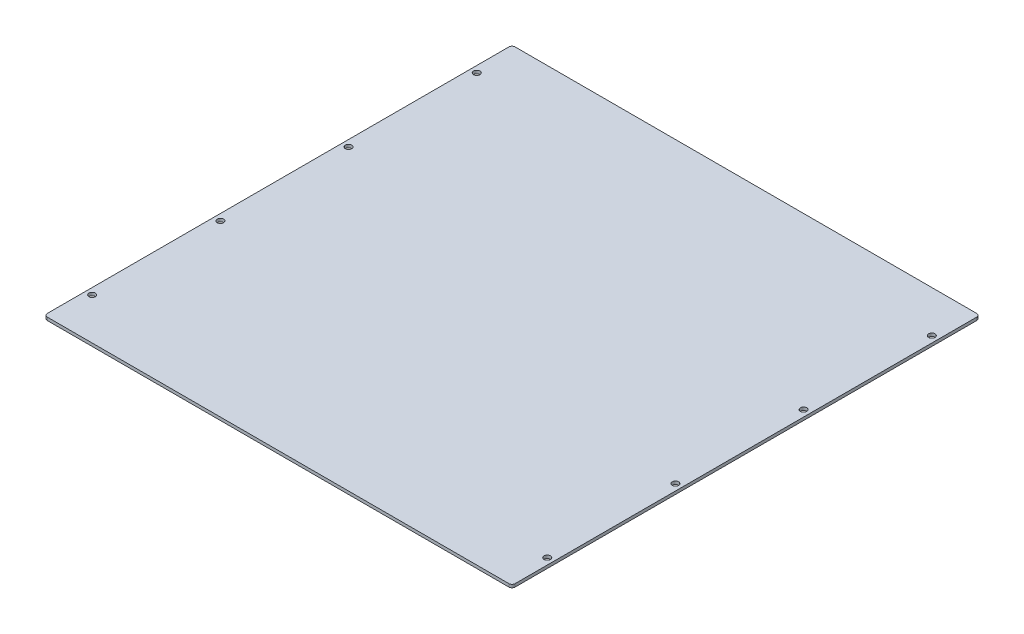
ISO-10303-21;
HEADER;
FILE_DESCRIPTION(('STEP AP214'),'2;1');
FILE_NAME('part.step','',(''),(''),'','','');
FILE_SCHEMA(('AUTOMOTIVE_DESIGN { 1 0 10303 214 1 1 1 1 }'));
ENDSEC;
DATA;
#1=APPLICATION_CONTEXT('core data for automotive mechanical design processes');
#2=APPLICATION_PROTOCOL_DEFINITION('international standard','automotive_design',2000,#1);
#3=PRODUCT_CONTEXT('',#1,'mechanical');
#4=PRODUCT('Part','Part','',(#3));
#5=PRODUCT_RELATED_PRODUCT_CATEGORY('part','',(#4));
#6=PRODUCT_DEFINITION_FORMATION('','',#4);
#7=PRODUCT_DEFINITION_CONTEXT('part definition',#1,'design');
#8=PRODUCT_DEFINITION('design','',#6,#7);
#9=PRODUCT_DEFINITION_SHAPE('','',#8);
#10=(LENGTH_UNIT() NAMED_UNIT(*) SI_UNIT(.MILLI.,.METRE.));
#11=(NAMED_UNIT(*) PLANE_ANGLE_UNIT() SI_UNIT($,.RADIAN.));
#12=(NAMED_UNIT(*) SI_UNIT($,.STERADIAN.) SOLID_ANGLE_UNIT());
#13=UNCERTAINTY_MEASURE_WITH_UNIT(LENGTH_MEASURE(1.E-05),#10,'distance_accuracy_value','');
#14=(GEOMETRIC_REPRESENTATION_CONTEXT(3) GLOBAL_UNCERTAINTY_ASSIGNED_CONTEXT((#13)) GLOBAL_UNIT_ASSIGNED_CONTEXT((#10,
#11,#12)) REPRESENTATION_CONTEXT('',''));
#15=CARTESIAN_POINT('',(0.,0.,0.));
#16=DIRECTION('',(0.,0.,1.));
#17=DIRECTION('',(1.,0.,0.));
#18=AXIS2_PLACEMENT_3D('',#15,#16,#17);
#19=CARTESIAN_POINT('',(231.775,2.9972,-231.775));
#20=DIRECTION('',(-1.,0.,0.));
#21=DIRECTION('',(0.,0.,1.));
#22=AXIS2_PLACEMENT_3D('',#19,#20,#21);
#23=PLANE('',#22);
#24=DIRECTION('',(0.,0.,-1.));
#25=VECTOR('',#24,1.);
#26=CARTESIAN_POINT('',(231.775,0.,-231.775));
#27=LINE('',#26,#25);
#28=CARTESIAN_POINT('',(231.775,0.,228.6));
#29=VERTEX_POINT('',#28);
#30=CARTESIAN_POINT('',(231.775,0.,-228.6));
#31=VERTEX_POINT('',#30);
#32=EDGE_CURVE('E149',#29,#31,#27,.T.);
#33=ORIENTED_EDGE('',*,*,#32,.T.);
#34=DIRECTION('',(0.,-1.,0.));
#35=VECTOR('',#34,1.);
#36=CARTESIAN_POINT('',(231.775,2.9972,-228.6));
#37=LINE('',#36,#35);
#38=CARTESIAN_POINT('',(231.775,2.9972,-228.6));
#39=VERTEX_POINT('',#38);
#40=EDGE_CURVE('E183',#31,#39,#37,.F.);
#41=ORIENTED_EDGE('',*,*,#40,.T.);
#42=DIRECTION('',(0.,0.,-1.));
#43=VECTOR('',#42,1.);
#44=CARTESIAN_POINT('',(231.775,2.9972,-231.775));
#45=LINE('',#44,#43);
#46=CARTESIAN_POINT('',(231.775,2.9972,228.6));
#47=VERTEX_POINT('',#46);
#48=EDGE_CURVE('E147',#47,#39,#45,.T.);
#49=ORIENTED_EDGE('',*,*,#48,.F.);
#50=DIRECTION('',(0.,-1.,0.));
#51=VECTOR('',#50,1.);
#52=CARTESIAN_POINT('',(231.775,2.9972,228.6));
#53=LINE('',#52,#51);
#54=EDGE_CURVE('E179',#47,#29,#53,.T.);
#55=ORIENTED_EDGE('',*,*,#54,.T.);
#56=EDGE_LOOP('',(#33,#41,#49,#55));
#57=FACE_BOUND('',#56,.T.);
#58=ADVANCED_FACE('F47',(#57),#23,.F.);
#59=CARTESIAN_POINT('',(-231.775,2.9972,-231.775));
#60=DIRECTION('',(0.,0.,1.));
#61=DIRECTION('',(1.,0.,0.));
#62=AXIS2_PLACEMENT_3D('',#59,#60,#61);
#63=PLANE('',#62);
#64=DIRECTION('',(-1.,0.,0.));
#65=VECTOR('',#64,1.);
#66=CARTESIAN_POINT('',(-231.775,0.,-231.775));
#67=LINE('',#66,#65);
#68=CARTESIAN_POINT('',(228.6,0.,-231.775));
#69=VERTEX_POINT('',#68);
#70=CARTESIAN_POINT('',(-228.6,0.,-231.775));
#71=VERTEX_POINT('',#70);
#72=EDGE_CURVE('E142',#69,#71,#67,.T.);
#73=ORIENTED_EDGE('',*,*,#72,.T.);
#74=DIRECTION('',(0.,-1.,0.));
#75=VECTOR('',#74,1.);
#76=CARTESIAN_POINT('',(-228.6,2.9972,-231.775));
#77=LINE('',#76,#75);
#78=CARTESIAN_POINT('',(-228.6,2.9972,-231.775));
#79=VERTEX_POINT('',#78);
#80=EDGE_CURVE('E118',#71,#79,#77,.F.);
#81=ORIENTED_EDGE('',*,*,#80,.T.);
#82=DIRECTION('',(-1.,0.,0.));
#83=VECTOR('',#82,1.);
#84=CARTESIAN_POINT('',(-231.775,2.9972,-231.775));
#85=LINE('',#84,#83);
#86=CARTESIAN_POINT('',(228.6,2.9972,-231.775));
#87=VERTEX_POINT('',#86);
#88=EDGE_CURVE('E203',#87,#79,#85,.T.);
#89=ORIENTED_EDGE('',*,*,#88,.F.);
#90=DIRECTION('',(0.,-1.,0.));
#91=VECTOR('',#90,1.);
#92=CARTESIAN_POINT('',(228.6,2.9972,-231.775));
#93=LINE('',#92,#91);
#94=EDGE_CURVE('E124',#87,#69,#93,.T.);
#95=ORIENTED_EDGE('',*,*,#94,.T.);
#96=EDGE_LOOP('',(#73,#81,#89,#95));
#97=FACE_BOUND('',#96,.T.);
#98=ADVANCED_FACE('F309',(#97),#63,.F.);
#99=CARTESIAN_POINT('',(-231.775,2.9972,-231.775));
#100=DIRECTION('',(1.,0.,0.));
#101=DIRECTION('',(0.,0.,-1.));
#102=AXIS2_PLACEMENT_3D('',#99,#100,#101);
#103=PLANE('',#102);
#104=DIRECTION('',(0.,0.,1.));
#105=VECTOR('',#104,1.);
#106=CARTESIAN_POINT('',(-231.775,2.9972,-231.775));
#107=LINE('',#106,#105);
#108=CARTESIAN_POINT('',(-231.775,2.9972,-228.6));
#109=VERTEX_POINT('',#108);
#110=CARTESIAN_POINT('',(-231.775,2.9972,228.6));
#111=VERTEX_POINT('',#110);
#112=EDGE_CURVE('E133',#109,#111,#107,.T.);
#113=ORIENTED_EDGE('',*,*,#112,.F.);
#114=DIRECTION('',(0.,-1.,0.));
#115=VECTOR('',#114,1.);
#116=CARTESIAN_POINT('',(-231.775,2.9972,-228.6));
#117=LINE('',#116,#115);
#118=CARTESIAN_POINT('',(-231.775,0.,-228.6));
#119=VERTEX_POINT('',#118);
#120=EDGE_CURVE('E117',#109,#119,#117,.T.);
#121=ORIENTED_EDGE('',*,*,#120,.T.);
#122=DIRECTION('',(0.,0.,1.));
#123=VECTOR('',#122,1.);
#124=CARTESIAN_POINT('',(-231.775,0.,-231.775));
#125=LINE('',#124,#123);
#126=CARTESIAN_POINT('',(-231.775,0.,228.6));
#127=VERTEX_POINT('',#126);
#128=EDGE_CURVE('E131',#119,#127,#125,.T.);
#129=ORIENTED_EDGE('',*,*,#128,.T.);
#130=DIRECTION('',(0.,-1.,0.));
#131=VECTOR('',#130,1.);
#132=CARTESIAN_POINT('',(-231.775,2.9972,228.6));
#133=LINE('',#132,#131);
#134=EDGE_CURVE('E136',#127,#111,#133,.F.);
#135=ORIENTED_EDGE('',*,*,#134,.T.);
#136=EDGE_LOOP('',(#113,#121,#129,#135));
#137=FACE_BOUND('',#136,.T.);
#138=ADVANCED_FACE('F130',(#137),#103,.F.);
#139=CARTESIAN_POINT('',(-231.775,2.9972,231.775));
#140=DIRECTION('',(0.,0.,-1.));
#141=DIRECTION('',(-1.,0.,0.));
#142=AXIS2_PLACEMENT_3D('',#139,#140,#141);
#143=PLANE('',#142);
#144=DIRECTION('',(1.,0.,0.));
#145=VECTOR('',#144,1.);
#146=CARTESIAN_POINT('',(-231.775,0.,231.775));
#147=LINE('',#146,#145);
#148=CARTESIAN_POINT('',(-228.6,0.,231.775));
#149=VERTEX_POINT('',#148);
#150=CARTESIAN_POINT('',(228.6,0.,231.775));
#151=VERTEX_POINT('',#150);
#152=EDGE_CURVE('E141',#149,#151,#147,.T.);
#153=ORIENTED_EDGE('',*,*,#152,.T.);
#154=DIRECTION('',(0.,-1.,0.));
#155=VECTOR('',#154,1.);
#156=CARTESIAN_POINT('',(228.6,2.9972,231.775));
#157=LINE('',#156,#155);
#158=CARTESIAN_POINT('',(228.6,2.9972,231.775));
#159=VERTEX_POINT('',#158);
#160=EDGE_CURVE('E13',#151,#159,#157,.F.);
#161=ORIENTED_EDGE('',*,*,#160,.T.);
#162=DIRECTION('',(1.,0.,0.));
#163=VECTOR('',#162,1.);
#164=CARTESIAN_POINT('',(-231.775,2.9972,231.775));
#165=LINE('',#164,#163);
#166=CARTESIAN_POINT('',(-228.6,2.9972,231.775));
#167=VERTEX_POINT('',#166);
#168=EDGE_CURVE('E154',#167,#159,#165,.T.);
#169=ORIENTED_EDGE('',*,*,#168,.F.);
#170=DIRECTION('',(0.,-1.,0.));
#171=VECTOR('',#170,1.);
#172=CARTESIAN_POINT('',(-228.6,2.9972,231.775));
#173=LINE('',#172,#171);
#174=EDGE_CURVE('E56',#167,#149,#173,.T.);
#175=ORIENTED_EDGE('',*,*,#174,.T.);
#176=EDGE_LOOP('',(#153,#161,#169,#175));
#177=FACE_BOUND('',#176,.T.);
#178=ADVANCED_FACE('F189',(#177),#143,.F.);
#179=CARTESIAN_POINT('',(0.,2.9972,0.));
#180=DIRECTION('',(0.,1.,0.));
#181=DIRECTION('',(0.,0.,1.));
#182=AXIS2_PLACEMENT_3D('',#179,#180,#181);
#183=PLANE('',#182);
#184=CARTESIAN_POINT('',(-225.425,2.9972,-190.5));
#185=DIRECTION('',(0.,1.,0.));
#186=DIRECTION('',(0.,0.,1.));
#187=AXIS2_PLACEMENT_3D('',#184,#185,#186);
#188=CIRCLE('',#187,3.17499999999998);
#189=CARTESIAN_POINT('',(-225.425,2.9972,-187.325));
#190=VERTEX_POINT('',#189);
#191=EDGE_CURVE('E282',#190,#190,#188,.T.);
#192=ORIENTED_EDGE('',*,*,#191,.F.);
#193=EDGE_LOOP('',(#192));
#194=FACE_BOUND('',#193,.T.);
#195=CARTESIAN_POINT('',(225.425,2.9972,-190.5));
#196=DIRECTION('',(0.,1.,0.));
#197=DIRECTION('',(0.,0.,1.));
#198=AXIS2_PLACEMENT_3D('',#195,#196,#197);
#199=CIRCLE('',#198,3.17499999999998);
#200=CARTESIAN_POINT('',(225.425,2.9972,-187.325));
#201=VERTEX_POINT('',#200);
#202=EDGE_CURVE('E274',#201,#201,#199,.T.);
#203=ORIENTED_EDGE('',*,*,#202,.F.);
#204=EDGE_LOOP('',(#203));
#205=FACE_BOUND('',#204,.T.);
#206=CARTESIAN_POINT('',(225.425,2.9972,-63.5000000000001));
#207=DIRECTION('',(0.,1.,0.));
#208=DIRECTION('',(0.,0.,1.));
#209=AXIS2_PLACEMENT_3D('',#206,#207,#208);
#210=CIRCLE('',#209,3.17499999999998);
#211=CARTESIAN_POINT('',(225.425,2.9972,-60.3250000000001));
#212=VERTEX_POINT('',#211);
#213=EDGE_CURVE('E266',#212,#212,#210,.T.);
#214=ORIENTED_EDGE('',*,*,#213,.F.);
#215=EDGE_LOOP('',(#214));
#216=FACE_BOUND('',#215,.T.);
#217=CARTESIAN_POINT('',(225.425,2.9972,63.4999999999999));
#218=DIRECTION('',(0.,1.,0.));
#219=DIRECTION('',(0.,0.,1.));
#220=AXIS2_PLACEMENT_3D('',#217,#218,#219);
#221=CIRCLE('',#220,3.17499999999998);
#222=CARTESIAN_POINT('',(225.425,2.9972,66.6749999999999));
#223=VERTEX_POINT('',#222);
#224=EDGE_CURVE('E258',#223,#223,#221,.T.);
#225=ORIENTED_EDGE('',*,*,#224,.F.);
#226=EDGE_LOOP('',(#225));
#227=FACE_BOUND('',#226,.T.);
#228=CARTESIAN_POINT('',(225.425,2.9972,190.5));
#229=DIRECTION('',(0.,1.,0.));
#230=DIRECTION('',(0.,0.,1.));
#231=AXIS2_PLACEMENT_3D('',#228,#229,#230);
#232=CIRCLE('',#231,3.17499999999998);
#233=CARTESIAN_POINT('',(225.425,2.9972,193.675));
#234=VERTEX_POINT('',#233);
#235=EDGE_CURVE('E250',#234,#234,#232,.T.);
#236=ORIENTED_EDGE('',*,*,#235,.F.);
#237=EDGE_LOOP('',(#236));
#238=FACE_BOUND('',#237,.T.);
#239=CARTESIAN_POINT('',(-225.425,2.9972,-63.5000000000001));
#240=DIRECTION('',(0.,1.,0.));
#241=DIRECTION('',(0.,0.,1.));
#242=AXIS2_PLACEMENT_3D('',#239,#240,#241);
#243=CIRCLE('',#242,3.17499999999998);
#244=CARTESIAN_POINT('',(-225.425,2.9972,-60.3250000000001));
#245=VERTEX_POINT('',#244);
#246=EDGE_CURVE('E242',#245,#245,#243,.T.);
#247=ORIENTED_EDGE('',*,*,#246,.F.);
#248=EDGE_LOOP('',(#247));
#249=FACE_BOUND('',#248,.T.);
#250=CARTESIAN_POINT('',(-225.425,2.9972,63.4999999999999));
#251=DIRECTION('',(0.,1.,0.));
#252=DIRECTION('',(0.,0.,1.));
#253=AXIS2_PLACEMENT_3D('',#250,#251,#252);
#254=CIRCLE('',#253,3.17499999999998);
#255=CARTESIAN_POINT('',(-225.425,2.9972,66.6749999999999));
#256=VERTEX_POINT('',#255);
#257=EDGE_CURVE('E232',#256,#256,#254,.T.);
#258=ORIENTED_EDGE('',*,*,#257,.F.);
#259=EDGE_LOOP('',(#258));
#260=FACE_BOUND('',#259,.T.);
#261=CARTESIAN_POINT('',(-225.425,2.9972,190.5));
#262=DIRECTION('',(0.,1.,0.));
#263=DIRECTION('',(0.,0.,1.));
#264=AXIS2_PLACEMENT_3D('',#261,#262,#263);
#265=CIRCLE('',#264,3.17499999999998);
#266=CARTESIAN_POINT('',(-225.425,2.9972,193.675));
#267=VERTEX_POINT('',#266);
#268=EDGE_CURVE('E220',#267,#267,#265,.T.);
#269=ORIENTED_EDGE('',*,*,#268,.F.);
#270=EDGE_LOOP('',(#269));
#271=FACE_BOUND('',#270,.T.);
#272=ORIENTED_EDGE('',*,*,#88,.T.);
#273=CARTESIAN_POINT('',(-228.6,2.9972,-228.6));
#274=DIRECTION('',(0.,1.,0.));
#275=DIRECTION('',(0.,0.,1.));
#276=AXIS2_PLACEMENT_3D('',#273,#274,#275);
#277=CIRCLE('',#276,3.175);
#278=EDGE_CURVE('E176',#79,#109,#277,.T.);
#279=ORIENTED_EDGE('',*,*,#278,.T.);
#280=ORIENTED_EDGE('',*,*,#112,.T.);
#281=CARTESIAN_POINT('',(-228.6,2.9972,228.6));
#282=DIRECTION('',(0.,1.,0.));
#283=DIRECTION('',(0.,0.,1.));
#284=AXIS2_PLACEMENT_3D('',#281,#282,#283);
#285=CIRCLE('',#284,3.175);
#286=EDGE_CURVE('E68',#111,#167,#285,.T.);
#287=ORIENTED_EDGE('',*,*,#286,.T.);
#288=ORIENTED_EDGE('',*,*,#168,.T.);
#289=CARTESIAN_POINT('',(228.6,2.9972,228.6));
#290=DIRECTION('',(0.,1.,0.));
#291=DIRECTION('',(0.,0.,1.));
#292=AXIS2_PLACEMENT_3D('',#289,#290,#291);
#293=CIRCLE('',#292,3.175);
#294=EDGE_CURVE('E170',#159,#47,#293,.T.);
#295=ORIENTED_EDGE('',*,*,#294,.T.);
#296=ORIENTED_EDGE('',*,*,#48,.T.);
#297=CARTESIAN_POINT('',(228.6,2.9972,-228.6));
#298=DIRECTION('',(0.,1.,0.));
#299=DIRECTION('',(0.,0.,1.));
#300=AXIS2_PLACEMENT_3D('',#297,#298,#299);
#301=CIRCLE('',#300,3.175);
#302=EDGE_CURVE('E173',#39,#87,#301,.T.);
#303=ORIENTED_EDGE('',*,*,#302,.T.);
#304=EDGE_LOOP('',(#272,#279,#280,#287,#288,#295,#296,#303));
#305=FACE_BOUND('',#304,.T.);
#306=ADVANCED_FACE('F290',(#194,#205,#216,#227,#238,#249,#260,#271,#305),#183,.T.);
#307=CARTESIAN_POINT('',(0.,0.,0.));
#308=DIRECTION('',(0.,1.,0.));
#309=DIRECTION('',(0.,0.,1.));
#310=AXIS2_PLACEMENT_3D('',#307,#308,#309);
#311=PLANE('',#310);
#312=CARTESIAN_POINT('',(-225.425,0.,-190.5));
#313=DIRECTION('',(0.,1.,0.));
#314=DIRECTION('',(0.,0.,1.));
#315=AXIS2_PLACEMENT_3D('',#312,#313,#314);
#316=CIRCLE('',#315,3.17499999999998);
#317=CARTESIAN_POINT('',(-225.425,0.,-187.325));
#318=VERTEX_POINT('',#317);
#319=EDGE_CURVE('E278',#318,#318,#316,.T.);
#320=ORIENTED_EDGE('',*,*,#319,.T.);
#321=EDGE_LOOP('',(#320));
#322=FACE_BOUND('',#321,.T.);
#323=CARTESIAN_POINT('',(225.425,0.,-190.5));
#324=DIRECTION('',(0.,1.,0.));
#325=DIRECTION('',(0.,0.,1.));
#326=AXIS2_PLACEMENT_3D('',#323,#324,#325);
#327=CIRCLE('',#326,3.17499999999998);
#328=CARTESIAN_POINT('',(225.425,0.,-187.325));
#329=VERTEX_POINT('',#328);
#330=EDGE_CURVE('E270',#329,#329,#327,.T.);
#331=ORIENTED_EDGE('',*,*,#330,.T.);
#332=EDGE_LOOP('',(#331));
#333=FACE_BOUND('',#332,.T.);
#334=CARTESIAN_POINT('',(225.425,0.,-63.5000000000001));
#335=DIRECTION('',(0.,1.,0.));
#336=DIRECTION('',(0.,0.,1.));
#337=AXIS2_PLACEMENT_3D('',#334,#335,#336);
#338=CIRCLE('',#337,3.17499999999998);
#339=CARTESIAN_POINT('',(225.425,0.,-60.3250000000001));
#340=VERTEX_POINT('',#339);
#341=EDGE_CURVE('E262',#340,#340,#338,.T.);
#342=ORIENTED_EDGE('',*,*,#341,.T.);
#343=EDGE_LOOP('',(#342));
#344=FACE_BOUND('',#343,.T.);
#345=CARTESIAN_POINT('',(225.425,0.,63.4999999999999));
#346=DIRECTION('',(0.,1.,0.));
#347=DIRECTION('',(0.,0.,1.));
#348=AXIS2_PLACEMENT_3D('',#345,#346,#347);
#349=CIRCLE('',#348,3.17499999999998);
#350=CARTESIAN_POINT('',(225.425,0.,66.6749999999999));
#351=VERTEX_POINT('',#350);
#352=EDGE_CURVE('E254',#351,#351,#349,.T.);
#353=ORIENTED_EDGE('',*,*,#352,.T.);
#354=EDGE_LOOP('',(#353));
#355=FACE_BOUND('',#354,.T.);
#356=CARTESIAN_POINT('',(225.425,0.,190.5));
#357=DIRECTION('',(0.,1.,0.));
#358=DIRECTION('',(0.,0.,1.));
#359=AXIS2_PLACEMENT_3D('',#356,#357,#358);
#360=CIRCLE('',#359,3.17499999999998);
#361=CARTESIAN_POINT('',(225.425,0.,193.675));
#362=VERTEX_POINT('',#361);
#363=EDGE_CURVE('E246',#362,#362,#360,.T.);
#364=ORIENTED_EDGE('',*,*,#363,.T.);
#365=EDGE_LOOP('',(#364));
#366=FACE_BOUND('',#365,.T.);
#367=CARTESIAN_POINT('',(-225.425,0.,-63.5000000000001));
#368=DIRECTION('',(0.,1.,0.));
#369=DIRECTION('',(0.,0.,1.));
#370=AXIS2_PLACEMENT_3D('',#367,#368,#369);
#371=CIRCLE('',#370,3.17499999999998);
#372=CARTESIAN_POINT('',(-225.425,0.,-60.3250000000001));
#373=VERTEX_POINT('',#372);
#374=EDGE_CURVE('E238',#373,#373,#371,.T.);
#375=ORIENTED_EDGE('',*,*,#374,.T.);
#376=EDGE_LOOP('',(#375));
#377=FACE_BOUND('',#376,.T.);
#378=CARTESIAN_POINT('',(-225.425,0.,63.4999999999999));
#379=DIRECTION('',(0.,1.,0.));
#380=DIRECTION('',(0.,0.,1.));
#381=AXIS2_PLACEMENT_3D('',#378,#379,#380);
#382=CIRCLE('',#381,3.17499999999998);
#383=CARTESIAN_POINT('',(-225.425,0.,66.6749999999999));
#384=VERTEX_POINT('',#383);
#385=EDGE_CURVE('E226',#384,#384,#382,.T.);
#386=ORIENTED_EDGE('',*,*,#385,.T.);
#387=EDGE_LOOP('',(#386));
#388=FACE_BOUND('',#387,.T.);
#389=CARTESIAN_POINT('',(-225.425,0.,190.5));
#390=DIRECTION('',(0.,1.,0.));
#391=DIRECTION('',(0.,0.,1.));
#392=AXIS2_PLACEMENT_3D('',#389,#390,#391);
#393=CIRCLE('',#392,3.17499999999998);
#394=CARTESIAN_POINT('',(-225.425,0.,193.675));
#395=VERTEX_POINT('',#394);
#396=EDGE_CURVE('E210',#395,#395,#393,.T.);
#397=ORIENTED_EDGE('',*,*,#396,.T.);
#398=EDGE_LOOP('',(#397));
#399=FACE_BOUND('',#398,.T.);
#400=ORIENTED_EDGE('',*,*,#128,.F.);
#401=CARTESIAN_POINT('',(-228.6,0.,-228.6));
#402=DIRECTION('',(0.,1.,0.));
#403=DIRECTION('',(0.,0.,1.));
#404=AXIS2_PLACEMENT_3D('',#401,#402,#403);
#405=CIRCLE('',#404,3.175);
#406=EDGE_CURVE('E113',#119,#71,#405,.F.);
#407=ORIENTED_EDGE('',*,*,#406,.T.);
#408=ORIENTED_EDGE('',*,*,#72,.F.);
#409=CARTESIAN_POINT('',(228.6,0.,-228.6));
#410=DIRECTION('',(0.,1.,0.));
#411=DIRECTION('',(0.,0.,1.));
#412=AXIS2_PLACEMENT_3D('',#409,#410,#411);
#413=CIRCLE('',#412,3.175);
#414=EDGE_CURVE('E125',#69,#31,#413,.F.);
#415=ORIENTED_EDGE('',*,*,#414,.T.);
#416=ORIENTED_EDGE('',*,*,#32,.F.);
#417=CARTESIAN_POINT('',(228.6,0.,228.6));
#418=DIRECTION('',(0.,1.,0.));
#419=DIRECTION('',(0.,0.,1.));
#420=AXIS2_PLACEMENT_3D('',#417,#418,#419);
#421=CIRCLE('',#420,3.175);
#422=EDGE_CURVE('E158',#29,#151,#421,.F.);
#423=ORIENTED_EDGE('',*,*,#422,.T.);
#424=ORIENTED_EDGE('',*,*,#152,.F.);
#425=CARTESIAN_POINT('',(-228.6,0.,228.6));
#426=DIRECTION('',(0.,1.,0.));
#427=DIRECTION('',(0.,0.,1.));
#428=AXIS2_PLACEMENT_3D('',#425,#426,#427);
#429=CIRCLE('',#428,3.175);
#430=EDGE_CURVE('E135',#149,#127,#429,.F.);
#431=ORIENTED_EDGE('',*,*,#430,.T.);
#432=EDGE_LOOP('',(#400,#407,#408,#415,#416,#423,#424,#431));
#433=FACE_BOUND('',#432,.T.);
#434=ADVANCED_FACE('F138',(#322,#333,#344,#355,#366,#377,#388,#399,#433),#311,.F.);
#435=CARTESIAN_POINT('',(-228.6,2.9972,-228.6));
#436=DIRECTION('',(0.,-1.,0.));
#437=DIRECTION('',(0.,0.,-1.));
#438=AXIS2_PLACEMENT_3D('',#435,#436,#437);
#439=CYLINDRICAL_SURFACE('',#438,3.175);
#440=ORIENTED_EDGE('',*,*,#278,.F.);
#441=ORIENTED_EDGE('',*,*,#80,.F.);
#442=ORIENTED_EDGE('',*,*,#406,.F.);
#443=ORIENTED_EDGE('',*,*,#120,.F.);
#444=EDGE_LOOP('',(#440,#441,#442,#443));
#445=FACE_BOUND('',#444,.T.);
#446=ADVANCED_FACE('F116',(#445),#439,.T.);
#447=CARTESIAN_POINT('',(228.6,2.9972,-228.6));
#448=DIRECTION('',(0.,-1.,0.));
#449=DIRECTION('',(0.,0.,-1.));
#450=AXIS2_PLACEMENT_3D('',#447,#448,#449);
#451=CYLINDRICAL_SURFACE('',#450,3.175);
#452=ORIENTED_EDGE('',*,*,#302,.F.);
#453=ORIENTED_EDGE('',*,*,#40,.F.);
#454=ORIENTED_EDGE('',*,*,#414,.F.);
#455=ORIENTED_EDGE('',*,*,#94,.F.);
#456=EDGE_LOOP('',(#452,#453,#454,#455));
#457=FACE_BOUND('',#456,.T.);
#458=ADVANCED_FACE('F311',(#457),#451,.T.);
#459=CARTESIAN_POINT('',(228.6,2.9972,228.6));
#460=DIRECTION('',(0.,-1.,0.));
#461=DIRECTION('',(0.,0.,-1.));
#462=AXIS2_PLACEMENT_3D('',#459,#460,#461);
#463=CYLINDRICAL_SURFACE('',#462,3.175);
#464=ORIENTED_EDGE('',*,*,#294,.F.);
#465=ORIENTED_EDGE('',*,*,#160,.F.);
#466=ORIENTED_EDGE('',*,*,#422,.F.);
#467=ORIENTED_EDGE('',*,*,#54,.F.);
#468=EDGE_LOOP('',(#464,#465,#466,#467));
#469=FACE_BOUND('',#468,.T.);
#470=ADVANCED_FACE('F196',(#469),#463,.T.);
#471=CARTESIAN_POINT('',(-228.6,2.9972,228.6));
#472=DIRECTION('',(0.,-1.,0.));
#473=DIRECTION('',(0.,0.,-1.));
#474=AXIS2_PLACEMENT_3D('',#471,#472,#473);
#475=CYLINDRICAL_SURFACE('',#474,3.175);
#476=ORIENTED_EDGE('',*,*,#286,.F.);
#477=ORIENTED_EDGE('',*,*,#134,.F.);
#478=ORIENTED_EDGE('',*,*,#430,.F.);
#479=ORIENTED_EDGE('',*,*,#174,.F.);
#480=EDGE_LOOP('',(#476,#477,#478,#479));
#481=FACE_BOUND('',#480,.T.);
#482=ADVANCED_FACE('F49',(#481),#475,.T.);
#483=CARTESIAN_POINT('',(-225.425,2.9972,190.5));
#484=DIRECTION('',(0.,1.,0.));
#485=DIRECTION('',(0.,0.,1.));
#486=AXIS2_PLACEMENT_3D('',#483,#484,#485);
#487=CYLINDRICAL_SURFACE('',#486,3.17499999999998);
#488=ORIENTED_EDGE('',*,*,#396,.F.);
#489=EDGE_LOOP('',(#488));
#490=FACE_BOUND('',#489,.T.);
#491=ORIENTED_EDGE('',*,*,#268,.T.);
#492=EDGE_LOOP('',(#491));
#493=FACE_BOUND('',#492,.T.);
#494=ADVANCED_FACE('F333',(#490,#493),#487,.F.);
#495=CARTESIAN_POINT('',(-225.425,2.9972,63.4999999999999));
#496=DIRECTION('',(0.,1.,0.));
#497=DIRECTION('',(0.,0.,1.));
#498=AXIS2_PLACEMENT_3D('',#495,#496,#497);
#499=CYLINDRICAL_SURFACE('',#498,3.17499999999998);
#500=ORIENTED_EDGE('',*,*,#385,.F.);
#501=EDGE_LOOP('',(#500));
#502=FACE_BOUND('',#501,.T.);
#503=ORIENTED_EDGE('',*,*,#257,.T.);
#504=EDGE_LOOP('',(#503));
#505=FACE_BOUND('',#504,.T.);
#506=ADVANCED_FACE('F336',(#502,#505),#499,.F.);
#507=CARTESIAN_POINT('',(-225.425,2.9972,-63.5000000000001));
#508=DIRECTION('',(0.,1.,0.));
#509=DIRECTION('',(0.,0.,1.));
#510=AXIS2_PLACEMENT_3D('',#507,#508,#509);
#511=CYLINDRICAL_SURFACE('',#510,3.17499999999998);
#512=ORIENTED_EDGE('',*,*,#374,.F.);
#513=EDGE_LOOP('',(#512));
#514=FACE_BOUND('',#513,.T.);
#515=ORIENTED_EDGE('',*,*,#246,.T.);
#516=EDGE_LOOP('',(#515));
#517=FACE_BOUND('',#516,.T.);
#518=ADVANCED_FACE('F340',(#514,#517),#511,.F.);
#519=CARTESIAN_POINT('',(225.425,2.9972,190.5));
#520=DIRECTION('',(0.,1.,0.));
#521=DIRECTION('',(0.,0.,1.));
#522=AXIS2_PLACEMENT_3D('',#519,#520,#521);
#523=CYLINDRICAL_SURFACE('',#522,3.17499999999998);
#524=ORIENTED_EDGE('',*,*,#363,.F.);
#525=EDGE_LOOP('',(#524));
#526=FACE_BOUND('',#525,.T.);
#527=ORIENTED_EDGE('',*,*,#235,.T.);
#528=EDGE_LOOP('',(#527));
#529=FACE_BOUND('',#528,.T.);
#530=ADVANCED_FACE('F344',(#526,#529),#523,.F.);
#531=CARTESIAN_POINT('',(225.425,2.9972,63.4999999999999));
#532=DIRECTION('',(0.,1.,0.));
#533=DIRECTION('',(0.,0.,1.));
#534=AXIS2_PLACEMENT_3D('',#531,#532,#533);
#535=CYLINDRICAL_SURFACE('',#534,3.17499999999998);
#536=ORIENTED_EDGE('',*,*,#352,.F.);
#537=EDGE_LOOP('',(#536));
#538=FACE_BOUND('',#537,.T.);
#539=ORIENTED_EDGE('',*,*,#224,.T.);
#540=EDGE_LOOP('',(#539));
#541=FACE_BOUND('',#540,.T.);
#542=ADVANCED_FACE('F348',(#538,#541),#535,.F.);
#543=CARTESIAN_POINT('',(225.425,2.9972,-63.5000000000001));
#544=DIRECTION('',(0.,1.,0.));
#545=DIRECTION('',(0.,0.,1.));
#546=AXIS2_PLACEMENT_3D('',#543,#544,#545);
#547=CYLINDRICAL_SURFACE('',#546,3.17499999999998);
#548=ORIENTED_EDGE('',*,*,#341,.F.);
#549=EDGE_LOOP('',(#548));
#550=FACE_BOUND('',#549,.T.);
#551=ORIENTED_EDGE('',*,*,#213,.T.);
#552=EDGE_LOOP('',(#551));
#553=FACE_BOUND('',#552,.T.);
#554=ADVANCED_FACE('F352',(#550,#553),#547,.F.);
#555=CARTESIAN_POINT('',(225.425,2.9972,-190.5));
#556=DIRECTION('',(0.,1.,0.));
#557=DIRECTION('',(0.,0.,1.));
#558=AXIS2_PLACEMENT_3D('',#555,#556,#557);
#559=CYLINDRICAL_SURFACE('',#558,3.17499999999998);
#560=ORIENTED_EDGE('',*,*,#330,.F.);
#561=EDGE_LOOP('',(#560));
#562=FACE_BOUND('',#561,.T.);
#563=ORIENTED_EDGE('',*,*,#202,.T.);
#564=EDGE_LOOP('',(#563));
#565=FACE_BOUND('',#564,.T.);
#566=ADVANCED_FACE('F356',(#562,#565),#559,.F.);
#567=CARTESIAN_POINT('',(-225.425,2.9972,-190.5));
#568=DIRECTION('',(0.,1.,0.));
#569=DIRECTION('',(0.,0.,1.));
#570=AXIS2_PLACEMENT_3D('',#567,#568,#569);
#571=CYLINDRICAL_SURFACE('',#570,3.17499999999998);
#572=ORIENTED_EDGE('',*,*,#319,.F.);
#573=EDGE_LOOP('',(#572));
#574=FACE_BOUND('',#573,.T.);
#575=ORIENTED_EDGE('',*,*,#191,.T.);
#576=EDGE_LOOP('',(#575));
#577=FACE_BOUND('',#576,.T.);
#578=ADVANCED_FACE('F288',(#574,#577),#571,.F.);
#579=CLOSED_SHELL('',(#58,#98,#138,#178,#306,#434,#446,#458,#470,#482,#494,#506,#518,#530,#542,
#554,#566,#578));
#580=MANIFOLD_SOLID_BREP('B2',#579);
#581=ADVANCED_BREP_SHAPE_REPRESENTATION('',(#18,#580),#14);
#582=SHAPE_DEFINITION_REPRESENTATION(#9,#581);
ENDSEC;
END-ISO-10303-21;
